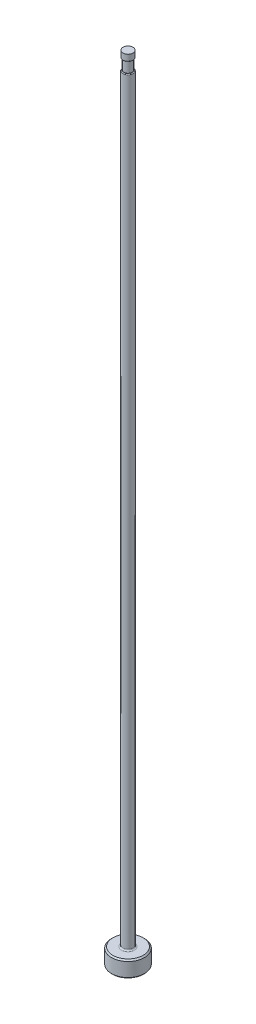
from build123d import *

# Parameters (mm, degrees)
CHAMFER1_SIZE     = 0.254
FILLET1_R         = 0.254
SKETCH2_W         = 0.2032
SKETCH2_H         = 2.032
D_SLOT_DEPTH      = 153.466131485
D_SLOT_DEPTH_BACK = 153.466131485
SKETCH5_W         = 0.01905
SKETCH5_H         = 1.27
FILLET2_R         = 0.127


with BuildPart() as part:
    # Sketch1 → Revolve1 (revolve)
    with BuildSketch(Plane.XY, mode=Mode.PRIVATE) as revolve1_sk:
        Polygon((0, 0), (-3.175, 0), (-3.175, 3.175), (-0.99187, 3.175), (-0.99187, 152.4), (0, 152.4), align=None)
    revolve(revolve1_sk.sketch.rotate(Axis((0, 259.958771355, 0), (0, -1, 0)), 270), axis=Axis((0, 259.958771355, 0), (0, -1, 0)))

    # Chamfer1
    chamfer1_edges = [part.edges().sort_by_distance(p)[0] for p in [
        (0, 3.175, -3.175),
        (0, 0, -3.175),
    ]]
    chamfer(chamfer1_edges, length=CHAMFER1_SIZE)

    # Fillet1
    fillet1_edges = [part.edges().sort_by_distance(p)[0] for p in [
        (0, 3.175, -0.99187),
    ]]
    fillet(fillet1_edges, radius=FILLET1_R)

    # Sketch2 → Vent Relief (revolve, cut)
    with BuildSketch(Plane.XY, mode=Mode.PRIVATE) as vent_relief_sk:
        with Locations((-0.89027, 150.114)):
            Rectangle(SKETCH2_W, SKETCH2_H)
    revolve(vent_relief_sk.sketch.rotate(Axis((0, 153.448281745, 0), (0, -1, 0)), 270), axis=Axis((0, 153.448281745, 0), (0, -1, 0)), mode=Mode.SUBTRACT)

    # Sketch3 → D-Slot (cut, two sides: drawn at the far end of the back side and taken through both)
    with BuildSketch(Plane.XY.offset(-D_SLOT_DEPTH_BACK)):
        with BuildLine():
            Line((-0.78867, 150.114), (-0.78867, 86.614))
            ThreePointArc((-0.78867, 86.614), (-0.839883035, 86.046038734), (-0.99187, 85.4964))
            Line((-0.99187, 85.4964), (-0.99187, 150.114))
            Line((-0.99187, 150.114), (-0.78867, 150.114))
        make_face()
    extrude(amount=D_SLOT_DEPTH + D_SLOT_DEPTH_BACK, mode=Mode.SUBTRACT)

    # Sketch5 → Vent Diameter (revolve, cut)
    with BuildSketch(Plane.XY, mode=Mode.PRIVATE) as vent_diameter_sk:
        with Locations((-0.982345, 151.765)):
            Rectangle(SKETCH5_W, SKETCH5_H)
    revolve(vent_diameter_sk.sketch.rotate(Axis((0, 152.687735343, 0), (0, -1, 0)), 90), axis=Axis((0, 152.687735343, 0), (0, -1, 0)), mode=Mode.SUBTRACT)

    # Fillet2
    fillet2_edges = [part.edges().sort_by_distance(p)[0] for p in [
        (0.888937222, 149.098, -0.439996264),
        (0, 151.13, 0.97282),
    ]]
    fillet(fillet2_edges, radius=FILLET2_R)


solid = part.part
